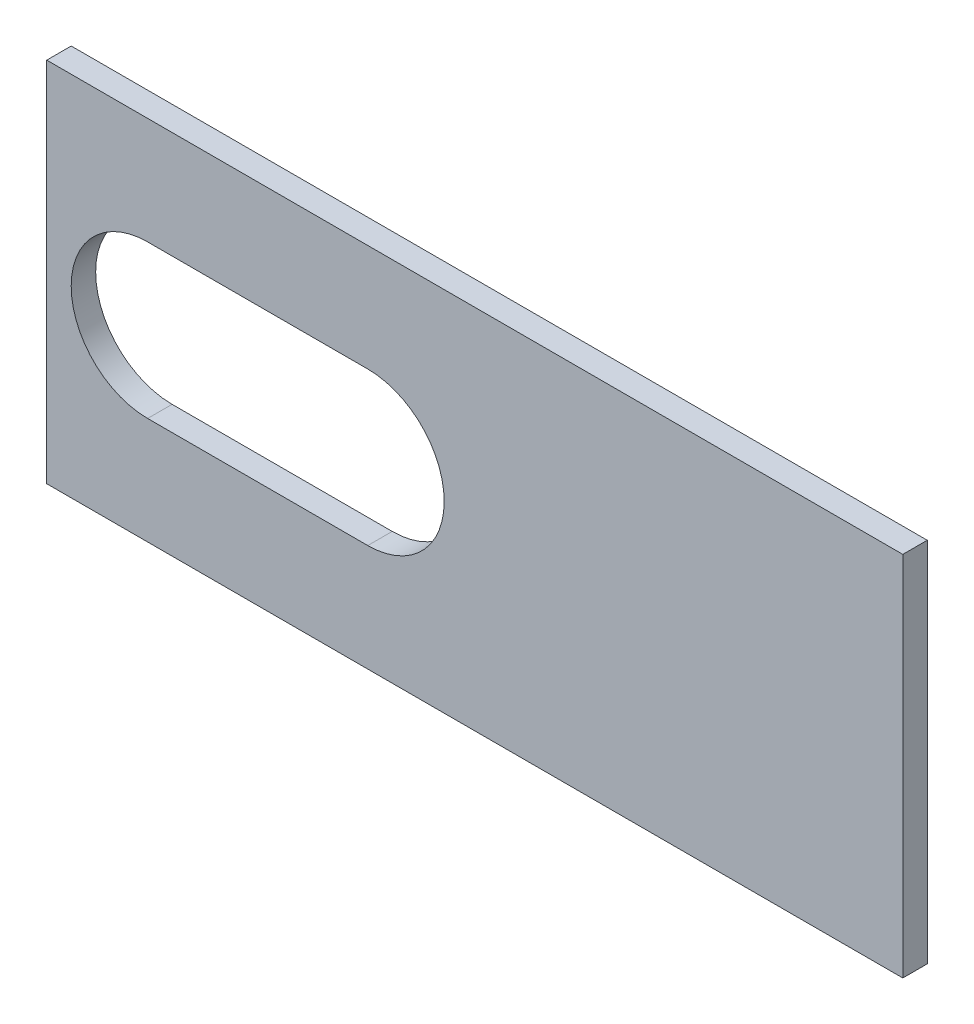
ISO-10303-21;
HEADER;
FILE_DESCRIPTION(('STEP AP214'),'2;1');
FILE_NAME('part.step','',(''),(''),'','','');
FILE_SCHEMA(('AUTOMOTIVE_DESIGN { 1 0 10303 214 1 1 1 1 }'));
ENDSEC;
DATA;
#1=APPLICATION_CONTEXT('core data for automotive mechanical design processes');
#2=APPLICATION_PROTOCOL_DEFINITION('international standard','automotive_design',2000,#1);
#3=PRODUCT_CONTEXT('',#1,'mechanical');
#4=PRODUCT('Part','Part','',(#3));
#5=PRODUCT_RELATED_PRODUCT_CATEGORY('part','',(#4));
#6=PRODUCT_DEFINITION_FORMATION('','',#4);
#7=PRODUCT_DEFINITION_CONTEXT('part definition',#1,'design');
#8=PRODUCT_DEFINITION('design','',#6,#7);
#9=PRODUCT_DEFINITION_SHAPE('','',#8);
#10=(LENGTH_UNIT() NAMED_UNIT(*) SI_UNIT(.MILLI.,.METRE.));
#11=(NAMED_UNIT(*) PLANE_ANGLE_UNIT() SI_UNIT($,.RADIAN.));
#12=(NAMED_UNIT(*) SI_UNIT($,.STERADIAN.) SOLID_ANGLE_UNIT());
#13=UNCERTAINTY_MEASURE_WITH_UNIT(LENGTH_MEASURE(1.E-05),#10,'distance_accuracy_value','');
#14=(GEOMETRIC_REPRESENTATION_CONTEXT(3) GLOBAL_UNCERTAINTY_ASSIGNED_CONTEXT((#13)) GLOBAL_UNIT_ASSIGNED_CONTEXT((#10,
#11,#12)) REPRESENTATION_CONTEXT('',''));
#15=CARTESIAN_POINT('',(0.,0.,0.));
#16=DIRECTION('',(0.,0.,1.));
#17=DIRECTION('',(1.,0.,0.));
#18=AXIS2_PLACEMENT_3D('',#15,#16,#17);
#19=CARTESIAN_POINT('',(350.,150.,20.));
#20=DIRECTION('',(-1.,0.,0.));
#21=DIRECTION('',(0.,-1.,0.));
#22=AXIS2_PLACEMENT_3D('',#19,#20,#21);
#23=PLANE('',#22);
#24=DIRECTION('',(0.,1.,0.));
#25=VECTOR('',#24,1.);
#26=CARTESIAN_POINT('',(350.,150.,0.));
#27=LINE('',#26,#25);
#28=CARTESIAN_POINT('',(350.,-150.,0.));
#29=VERTEX_POINT('',#28);
#30=CARTESIAN_POINT('',(350.,150.,0.));
#31=VERTEX_POINT('',#30);
#32=EDGE_CURVE('E130',#29,#31,#27,.T.);
#33=ORIENTED_EDGE('',*,*,#32,.T.);
#34=DIRECTION('',(0.,0.,-1.));
#35=VECTOR('',#34,1.);
#36=CARTESIAN_POINT('',(350.,150.,20.));
#37=LINE('',#36,#35);
#38=CARTESIAN_POINT('',(350.,150.,20.));
#39=VERTEX_POINT('',#38);
#40=EDGE_CURVE('E11',#39,#31,#37,.T.);
#41=ORIENTED_EDGE('',*,*,#40,.F.);
#42=DIRECTION('',(0.,1.,0.));
#43=VECTOR('',#42,1.);
#44=CARTESIAN_POINT('',(350.,150.,20.));
#45=LINE('',#44,#43);
#46=CARTESIAN_POINT('',(350.,-150.,20.));
#47=VERTEX_POINT('',#46);
#48=EDGE_CURVE('E134',#47,#39,#45,.T.);
#49=ORIENTED_EDGE('',*,*,#48,.F.);
#50=DIRECTION('',(0.,0.,-1.));
#51=VECTOR('',#50,1.);
#52=CARTESIAN_POINT('',(350.,-150.,20.));
#53=LINE('',#52,#51);
#54=EDGE_CURVE('E144',#47,#29,#53,.T.);
#55=ORIENTED_EDGE('',*,*,#54,.T.);
#56=EDGE_LOOP('',(#33,#41,#49,#55));
#57=FACE_BOUND('',#56,.T.);
#58=ADVANCED_FACE('F33',(#57),#23,.F.);
#59=CARTESIAN_POINT('',(-350.,150.,20.));
#60=DIRECTION('',(0.,-1.,0.));
#61=DIRECTION('',(0.,0.,-1.));
#62=AXIS2_PLACEMENT_3D('',#59,#60,#61);
#63=PLANE('',#62);
#64=DIRECTION('',(-1.,0.,0.));
#65=VECTOR('',#64,1.);
#66=CARTESIAN_POINT('',(-350.,150.,0.));
#67=LINE('',#66,#65);
#68=CARTESIAN_POINT('',(-350.,150.,0.));
#69=VERTEX_POINT('',#68);
#70=EDGE_CURVE('E147',#31,#69,#67,.T.);
#71=ORIENTED_EDGE('',*,*,#70,.T.);
#72=DIRECTION('',(0.,0.,-1.));
#73=VECTOR('',#72,1.);
#74=CARTESIAN_POINT('',(-350.,150.,20.));
#75=LINE('',#74,#73);
#76=CARTESIAN_POINT('',(-350.,150.,20.));
#77=VERTEX_POINT('',#76);
#78=EDGE_CURVE('E40',#77,#69,#75,.T.);
#79=ORIENTED_EDGE('',*,*,#78,.F.);
#80=DIRECTION('',(-1.,0.,0.));
#81=VECTOR('',#80,1.);
#82=CARTESIAN_POINT('',(-350.,150.,20.));
#83=LINE('',#82,#81);
#84=EDGE_CURVE('E137',#39,#77,#83,.T.);
#85=ORIENTED_EDGE('',*,*,#84,.F.);
#86=ORIENTED_EDGE('',*,*,#40,.T.);
#87=EDGE_LOOP('',(#71,#79,#85,#86));
#88=FACE_BOUND('',#87,.T.);
#89=ADVANCED_FACE('F175',(#88),#63,.F.);
#90=CARTESIAN_POINT('',(-350.,150.,20.));
#91=DIRECTION('',(1.,0.,0.));
#92=DIRECTION('',(0.,0.,-1.));
#93=AXIS2_PLACEMENT_3D('',#90,#91,#92);
#94=PLANE('',#93);
#95=DIRECTION('',(0.,-1.,0.));
#96=VECTOR('',#95,1.);
#97=CARTESIAN_POINT('',(-350.,150.,0.));
#98=LINE('',#97,#96);
#99=CARTESIAN_POINT('',(-350.,-150.,0.));
#100=VERTEX_POINT('',#99);
#101=EDGE_CURVE('E149',#69,#100,#98,.T.);
#102=ORIENTED_EDGE('',*,*,#101,.T.);
#103=DIRECTION('',(0.,0.,-1.));
#104=VECTOR('',#103,1.);
#105=CARTESIAN_POINT('',(-350.,-150.,20.));
#106=LINE('',#105,#104);
#107=CARTESIAN_POINT('',(-350.,-150.,20.));
#108=VERTEX_POINT('',#107);
#109=EDGE_CURVE('E154',#108,#100,#106,.T.);
#110=ORIENTED_EDGE('',*,*,#109,.F.);
#111=DIRECTION('',(0.,-1.,0.));
#112=VECTOR('',#111,1.);
#113=CARTESIAN_POINT('',(-350.,150.,20.));
#114=LINE('',#113,#112);
#115=EDGE_CURVE('E140',#77,#108,#114,.T.);
#116=ORIENTED_EDGE('',*,*,#115,.F.);
#117=ORIENTED_EDGE('',*,*,#78,.T.);
#118=EDGE_LOOP('',(#102,#110,#116,#117));
#119=FACE_BOUND('',#118,.T.);
#120=ADVANCED_FACE('F161',(#119),#94,.F.);
#121=CARTESIAN_POINT('',(-350.,-150.,20.));
#122=DIRECTION('',(0.,1.,0.));
#123=DIRECTION('',(0.,0.,1.));
#124=AXIS2_PLACEMENT_3D('',#121,#122,#123);
#125=PLANE('',#124);
#126=DIRECTION('',(1.,0.,0.));
#127=VECTOR('',#126,1.);
#128=CARTESIAN_POINT('',(-350.,-150.,0.));
#129=LINE('',#128,#127);
#130=EDGE_CURVE('E138',#100,#29,#129,.T.);
#131=ORIENTED_EDGE('',*,*,#130,.T.);
#132=ORIENTED_EDGE('',*,*,#54,.F.);
#133=DIRECTION('',(1.,0.,0.));
#134=VECTOR('',#133,1.);
#135=CARTESIAN_POINT('',(-350.,-150.,20.));
#136=LINE('',#135,#134);
#137=EDGE_CURVE('E142',#108,#47,#136,.T.);
#138=ORIENTED_EDGE('',*,*,#137,.F.);
#139=ORIENTED_EDGE('',*,*,#109,.T.);
#140=EDGE_LOOP('',(#131,#132,#138,#139));
#141=FACE_BOUND('',#140,.T.);
#142=ADVANCED_FACE('F168',(#141),#125,.F.);
#143=CARTESIAN_POINT('',(0.,0.,20.));
#144=DIRECTION('',(0.,0.,1.));
#145=DIRECTION('',(1.,0.,0.));
#146=AXIS2_PLACEMENT_3D('',#143,#144,#145);
#147=PLANE('',#146);
#148=CARTESIAN_POINT('',(-267.5,-1.07840686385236E-13,20.));
#149=DIRECTION('',(0.,0.,1.));
#150=DIRECTION('',(1.,0.,0.));
#151=AXIS2_PLACEMENT_3D('',#148,#149,#150);
#152=CIRCLE('',#151,62.4999999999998);
#153=CARTESIAN_POINT('',(-267.5,62.4999999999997,20.));
#154=VERTEX_POINT('',#153);
#155=CARTESIAN_POINT('',(-267.5,-62.4999999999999,20.));
#156=VERTEX_POINT('',#155);
#157=EDGE_CURVE('E47',#154,#156,#152,.T.);
#158=ORIENTED_EDGE('',*,*,#157,.F.);
#159=DIRECTION('',(-1.,0.,0.));
#160=VECTOR('',#159,1.);
#161=CARTESIAN_POINT('',(-267.5,62.4999999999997,20.));
#162=LINE('',#161,#160);
#163=CARTESIAN_POINT('',(-87.4999999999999,62.5000000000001,20.));
#164=VERTEX_POINT('',#163);
#165=EDGE_CURVE('E115',#164,#154,#162,.T.);
#166=ORIENTED_EDGE('',*,*,#165,.F.);
#167=CARTESIAN_POINT('',(-87.4999999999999,0.,20.));
#168=DIRECTION('',(0.,0.,1.));
#169=DIRECTION('',(1.,0.,0.));
#170=AXIS2_PLACEMENT_3D('',#167,#168,#169);
#171=CIRCLE('',#170,62.5);
#172=CARTESIAN_POINT('',(-87.4999999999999,-62.5000000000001,20.));
#173=VERTEX_POINT('',#172);
#174=EDGE_CURVE('E118',#173,#164,#171,.T.);
#175=ORIENTED_EDGE('',*,*,#174,.F.);
#176=DIRECTION('',(1.,0.,0.));
#177=VECTOR('',#176,1.);
#178=CARTESIAN_POINT('',(-267.5,-62.4999999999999,20.));
#179=LINE('',#178,#177);
#180=EDGE_CURVE('E124',#156,#173,#179,.T.);
#181=ORIENTED_EDGE('',*,*,#180,.F.);
#182=EDGE_LOOP('',(#158,#166,#175,#181));
#183=FACE_BOUND('',#182,.T.);
#184=ORIENTED_EDGE('',*,*,#48,.T.);
#185=ORIENTED_EDGE('',*,*,#84,.T.);
#186=ORIENTED_EDGE('',*,*,#115,.T.);
#187=ORIENTED_EDGE('',*,*,#137,.T.);
#188=EDGE_LOOP('',(#184,#185,#186,#187));
#189=FACE_BOUND('',#188,.T.);
#190=ADVANCED_FACE('F174',(#183,#189),#147,.T.);
#191=CARTESIAN_POINT('',(0.,0.,0.));
#192=DIRECTION('',(0.,0.,1.));
#193=DIRECTION('',(1.,0.,0.));
#194=AXIS2_PLACEMENT_3D('',#191,#192,#193);
#195=PLANE('',#194);
#196=DIRECTION('',(-1.,0.,0.));
#197=VECTOR('',#196,1.);
#198=CARTESIAN_POINT('',(-267.5,62.4999999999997,0.));
#199=LINE('',#198,#197);
#200=CARTESIAN_POINT('',(-87.4999999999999,62.5000000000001,0.));
#201=VERTEX_POINT('',#200);
#202=CARTESIAN_POINT('',(-267.5,62.4999999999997,0.));
#203=VERTEX_POINT('',#202);
#204=EDGE_CURVE('E105',#201,#203,#199,.T.);
#205=ORIENTED_EDGE('',*,*,#204,.T.);
#206=CARTESIAN_POINT('',(-267.5,-1.07840686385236E-13,0.));
#207=DIRECTION('',(0.,0.,1.));
#208=DIRECTION('',(1.,0.,0.));
#209=AXIS2_PLACEMENT_3D('',#206,#207,#208);
#210=CIRCLE('',#209,62.4999999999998);
#211=CARTESIAN_POINT('',(-267.5,-62.4999999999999,0.));
#212=VERTEX_POINT('',#211);
#213=EDGE_CURVE('E99',#203,#212,#210,.T.);
#214=ORIENTED_EDGE('',*,*,#213,.T.);
#215=DIRECTION('',(1.,0.,0.));
#216=VECTOR('',#215,1.);
#217=CARTESIAN_POINT('',(-267.5,-62.4999999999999,0.));
#218=LINE('',#217,#216);
#219=CARTESIAN_POINT('',(-87.4999999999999,-62.4999999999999,0.));
#220=VERTEX_POINT('',#219);
#221=EDGE_CURVE('E108',#212,#220,#218,.T.);
#222=ORIENTED_EDGE('',*,*,#221,.T.);
#223=CARTESIAN_POINT('',(-87.4999999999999,0.,0.));
#224=DIRECTION('',(0.,0.,1.));
#225=DIRECTION('',(1.,0.,0.));
#226=AXIS2_PLACEMENT_3D('',#223,#224,#225);
#227=CIRCLE('',#226,62.5);
#228=EDGE_CURVE('E55',#220,#201,#227,.T.);
#229=ORIENTED_EDGE('',*,*,#228,.T.);
#230=EDGE_LOOP('',(#205,#214,#222,#229));
#231=FACE_BOUND('',#230,.T.);
#232=ORIENTED_EDGE('',*,*,#32,.F.);
#233=ORIENTED_EDGE('',*,*,#130,.F.);
#234=ORIENTED_EDGE('',*,*,#101,.F.);
#235=ORIENTED_EDGE('',*,*,#70,.F.);
#236=EDGE_LOOP('',(#232,#233,#234,#235));
#237=FACE_BOUND('',#236,.T.);
#238=ADVANCED_FACE('F112',(#231,#237),#195,.F.);
#239=CARTESIAN_POINT('',(-267.5,-1.07840686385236E-13,0.));
#240=DIRECTION('',(0.,0.,1.));
#241=DIRECTION('',(1.,0.,0.));
#242=AXIS2_PLACEMENT_3D('',#239,#240,#241);
#243=CYLINDRICAL_SURFACE('',#242,62.4999999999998);
#244=ORIENTED_EDGE('',*,*,#157,.T.);
#245=DIRECTION('',(0.,0.,1.));
#246=VECTOR('',#245,1.);
#247=CARTESIAN_POINT('',(-267.5,-62.4999999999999,0.));
#248=LINE('',#247,#246);
#249=EDGE_CURVE('E95',#212,#156,#248,.T.);
#250=ORIENTED_EDGE('',*,*,#249,.F.);
#251=ORIENTED_EDGE('',*,*,#213,.F.);
#252=DIRECTION('',(0.,0.,1.));
#253=VECTOR('',#252,1.);
#254=CARTESIAN_POINT('',(-267.5,62.4999999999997,0.));
#255=LINE('',#254,#253);
#256=EDGE_CURVE('E128',#203,#154,#255,.T.);
#257=ORIENTED_EDGE('',*,*,#256,.T.);
#258=EDGE_LOOP('',(#244,#250,#251,#257));
#259=FACE_BOUND('',#258,.T.);
#260=ADVANCED_FACE('F97',(#259),#243,.F.);
#261=CARTESIAN_POINT('',(-267.5,62.4999999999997,0.));
#262=DIRECTION('',(0.,1.,0.));
#263=DIRECTION('',(-1.,0.,0.));
#264=AXIS2_PLACEMENT_3D('',#261,#262,#263);
#265=PLANE('',#264);
#266=ORIENTED_EDGE('',*,*,#165,.T.);
#267=ORIENTED_EDGE('',*,*,#256,.F.);
#268=ORIENTED_EDGE('',*,*,#204,.F.);
#269=DIRECTION('',(0.,0.,1.));
#270=VECTOR('',#269,1.);
#271=CARTESIAN_POINT('',(-87.4999999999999,62.5000000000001,0.));
#272=LINE('',#271,#270);
#273=EDGE_CURVE('E131',#201,#164,#272,.T.);
#274=ORIENTED_EDGE('',*,*,#273,.T.);
#275=EDGE_LOOP('',(#266,#267,#268,#274));
#276=FACE_BOUND('',#275,.T.);
#277=ADVANCED_FACE('F192',(#276),#265,.F.);
#278=CARTESIAN_POINT('',(-87.4999999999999,0.,0.));
#279=DIRECTION('',(0.,0.,1.));
#280=DIRECTION('',(1.,0.,0.));
#281=AXIS2_PLACEMENT_3D('',#278,#279,#280);
#282=CYLINDRICAL_SURFACE('',#281,62.5);
#283=ORIENTED_EDGE('',*,*,#174,.T.);
#284=ORIENTED_EDGE('',*,*,#273,.F.);
#285=ORIENTED_EDGE('',*,*,#228,.F.);
#286=DIRECTION('',(0.,0.,1.));
#287=VECTOR('',#286,1.);
#288=CARTESIAN_POINT('',(-87.4999999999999,-62.5000000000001,0.));
#289=LINE('',#288,#287);
#290=EDGE_CURVE('E104',#220,#173,#289,.T.);
#291=ORIENTED_EDGE('',*,*,#290,.T.);
#292=EDGE_LOOP('',(#283,#284,#285,#291));
#293=FACE_BOUND('',#292,.T.);
#294=ADVANCED_FACE('F195',(#293),#282,.F.);
#295=CARTESIAN_POINT('',(-267.5,-62.4999999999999,0.));
#296=DIRECTION('',(0.,-1.,0.));
#297=DIRECTION('',(1.,0.,0.));
#298=AXIS2_PLACEMENT_3D('',#295,#296,#297);
#299=PLANE('',#298);
#300=ORIENTED_EDGE('',*,*,#180,.T.);
#301=ORIENTED_EDGE('',*,*,#290,.F.);
#302=ORIENTED_EDGE('',*,*,#221,.F.);
#303=ORIENTED_EDGE('',*,*,#249,.T.);
#304=EDGE_LOOP('',(#300,#301,#302,#303));
#305=FACE_BOUND('',#304,.T.);
#306=ADVANCED_FACE('F109',(#305),#299,.F.);
#307=CLOSED_SHELL('',(#58,#89,#120,#142,#190,#238,#260,#277,#294,#306));
#308=MANIFOLD_SOLID_BREP('B2',#307);
#309=ADVANCED_BREP_SHAPE_REPRESENTATION('',(#18,#308),#14);
#310=SHAPE_DEFINITION_REPRESENTATION(#9,#309);
ENDSEC;
END-ISO-10303-21;
